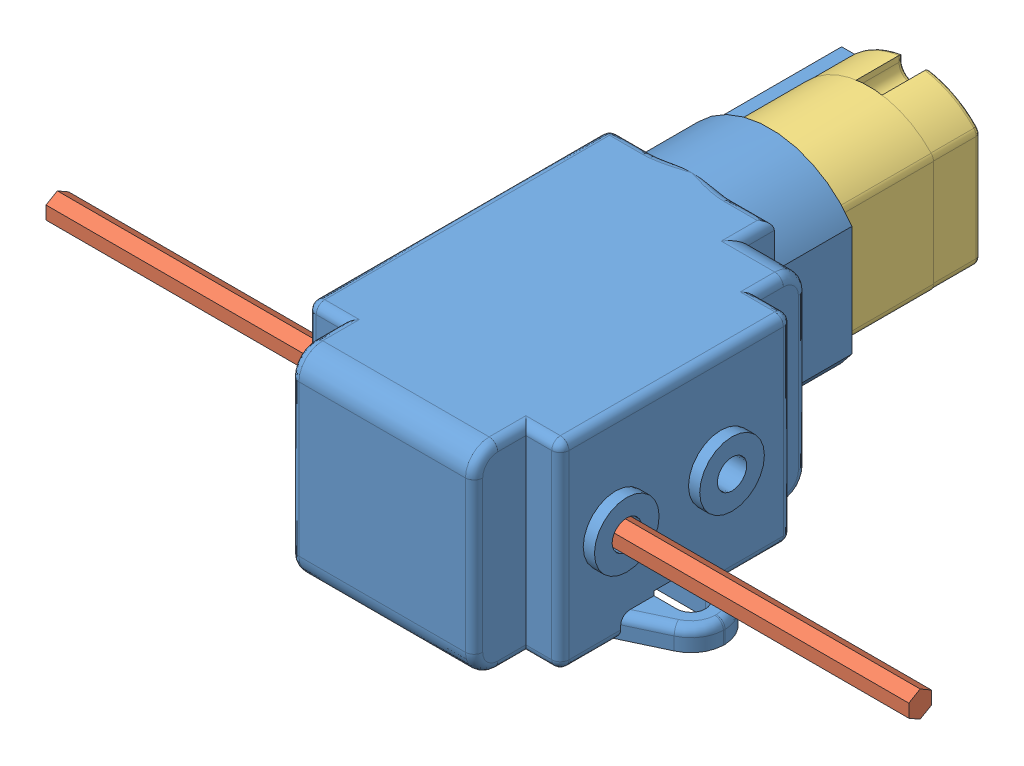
SolidWorks assembly TAM-70167-M.SLDASM, configuration Défaut (file format 8000). Lengths in mm.
Overall size (100 23 70.5).
3 component instances, 3 part files, 4 mates.
Components (placement in the parent):
- TAM-70167_corps-1: TAM-70167_corps.SLDPRT [Défaut] at (-18.3338 -0.2093 76.85) size (42.31 23 67.9)
- TAM-70167_axe100-1: TAM-70167_axe100.SLDPRT [Défaut] at (-53.7338 -0.2093 89.45) size (100 3.04 2.63)
- TAM-1117_Moteur-1: TAM-1117_Moteur.SLDPRT [Défaut] at (-8.7838 -0.2093 40.35) size (15 19.9 38.5)
Mates (geometry in assembly coordinates):
- Coïncidente1: coincident: axis of TAM-70167_corps-1 through (-8.7838 -0.2093 60.85) axis (0 0 -1); axis of TAM-1117_Moteur-1 through (-8.7838 -0.2093 35.35) axis (0 0 1)
- Parallèle1: parallel anti-aligned: plane of TAM-70167_corps-1 through (-16.8338 5.7235 60.85) normal (1 0 0); plane of TAM-1117_Moteur-1 through (-16.2838 8.1351 40.35) normal (-1 0 0)
- Coïncidente3: coincident anti-aligned: plane of TAM-70167_corps-1 through (-8.7838 -0.2093 60.85) normal (0 0 -1); plane of TAM-1117_Moteur-1 through (-8.7838 -0.2093 60.85) normal (0 0 1)
- Distance1: distance = 34 mm aligned: plane of TAM-70167_axe100-1 through (46.2662 -0.2093 89.45) normal (1 0 0); plane of TAM-70167_corps-1 through (12.2662 -0.2093 89.45) normal (1 0 0)
